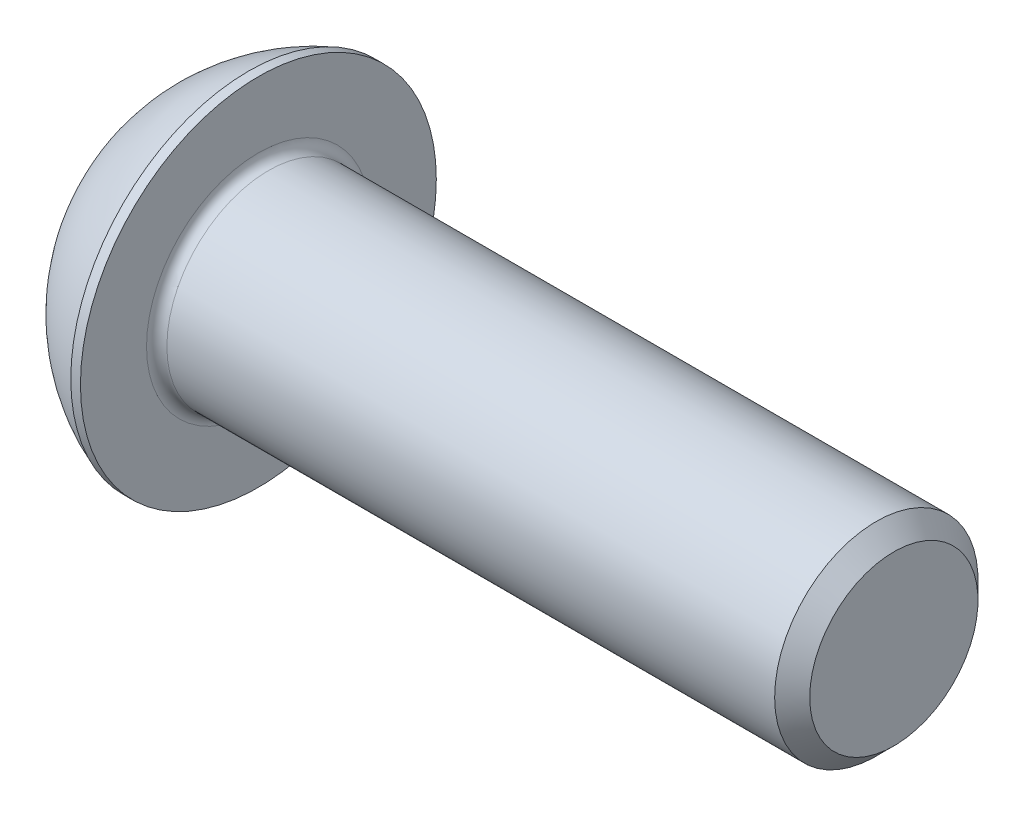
ISO-10303-21;
HEADER;
FILE_DESCRIPTION(('STEP AP214'),'2;1');
FILE_NAME('part.step','',(''),(''),'','','');
FILE_SCHEMA(('AUTOMOTIVE_DESIGN { 1 0 10303 214 1 1 1 1 }'));
ENDSEC;
DATA;
#1=APPLICATION_CONTEXT('core data for automotive mechanical design processes');
#2=APPLICATION_PROTOCOL_DEFINITION('international standard','automotive_design',2000,#1);
#3=PRODUCT_CONTEXT('',#1,'mechanical');
#4=PRODUCT('Part','Part','',(#3));
#5=PRODUCT_RELATED_PRODUCT_CATEGORY('part','',(#4));
#6=PRODUCT_DEFINITION_FORMATION('','',#4);
#7=PRODUCT_DEFINITION_CONTEXT('part definition',#1,'design');
#8=PRODUCT_DEFINITION('design','',#6,#7);
#9=PRODUCT_DEFINITION_SHAPE('','',#8);
#10=(LENGTH_UNIT() NAMED_UNIT(*) SI_UNIT(.MILLI.,.METRE.));
#11=(NAMED_UNIT(*) PLANE_ANGLE_UNIT() SI_UNIT($,.RADIAN.));
#12=(NAMED_UNIT(*) SI_UNIT($,.STERADIAN.) SOLID_ANGLE_UNIT());
#13=UNCERTAINTY_MEASURE_WITH_UNIT(LENGTH_MEASURE(1.E-05),#10,'distance_accuracy_value','');
#14=(GEOMETRIC_REPRESENTATION_CONTEXT(3) GLOBAL_UNCERTAINTY_ASSIGNED_CONTEXT((#13)) GLOBAL_UNIT_ASSIGNED_CONTEXT((#10,
#11,#12)) REPRESENTATION_CONTEXT('',''));
#15=CARTESIAN_POINT('',(0.,0.,0.));
#16=DIRECTION('',(0.,0.,1.));
#17=DIRECTION('',(1.,0.,0.));
#18=AXIS2_PLACEMENT_3D('',#15,#16,#17);
#19=CARTESIAN_POINT('',(0.,0.,0.));
#20=DIRECTION('',(-1.,0.,0.));
#21=DIRECTION('',(0.,0.,1.));
#22=AXIS2_PLACEMENT_3D('',#19,#20,#21);
#23=PLANE('',#22);
#24=CARTESIAN_POINT('',(0.,0.,0.));
#25=DIRECTION('',(-1.,0.,0.));
#26=DIRECTION('',(0.,0.,1.));
#27=AXIS2_PLACEMENT_3D('',#24,#25,#26);
#28=CIRCLE('',#27,3.5);
#29=CARTESIAN_POINT('',(0.,3.5,0.));
#30=VERTEX_POINT('',#29);
#31=EDGE_CURVE('E174',#30,#30,#28,.T.);
#32=ORIENTED_EDGE('',*,*,#31,.T.);
#33=EDGE_LOOP('',(#32));
#34=FACE_BOUND('',#33,.T.);
#35=DIRECTION('',(0.,-1.,0.));
#36=VECTOR('',#35,1.);
#37=CARTESIAN_POINT('',(0.,-1.44337567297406,2.5));
#38=LINE('',#37,#36);
#39=CARTESIAN_POINT('',(0.,1.44337567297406,2.5));
#40=VERTEX_POINT('',#39);
#41=CARTESIAN_POINT('',(0.,-1.44337567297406,2.5));
#42=VERTEX_POINT('',#41);
#43=EDGE_CURVE('E59',#40,#42,#38,.T.);
#44=ORIENTED_EDGE('',*,*,#43,.T.);
#45=DIRECTION('',(0.,-0.5,-0.866025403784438));
#46=VECTOR('',#45,1.);
#47=CARTESIAN_POINT('',(0.,-2.88675134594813,0.));
#48=LINE('',#47,#46);
#49=CARTESIAN_POINT('',(0.,-2.88675134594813,0.));
#50=VERTEX_POINT('',#49);
#51=EDGE_CURVE('E301',#42,#50,#48,.T.);
#52=ORIENTED_EDGE('',*,*,#51,.T.);
#53=DIRECTION('',(0.,0.5,-0.866025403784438));
#54=VECTOR('',#53,1.);
#55=CARTESIAN_POINT('',(0.,-1.44337567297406,-2.5));
#56=LINE('',#55,#54);
#57=CARTESIAN_POINT('',(0.,-1.44337567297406,-2.5));
#58=VERTEX_POINT('',#57);
#59=EDGE_CURVE('E141',#50,#58,#56,.T.);
#60=ORIENTED_EDGE('',*,*,#59,.T.);
#61=DIRECTION('',(0.,1.,0.));
#62=VECTOR('',#61,1.);
#63=CARTESIAN_POINT('',(0.,1.44337567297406,-2.5));
#64=LINE('',#63,#62);
#65=CARTESIAN_POINT('',(0.,1.44337567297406,-2.5));
#66=VERTEX_POINT('',#65);
#67=EDGE_CURVE('E306',#58,#66,#64,.T.);
#68=ORIENTED_EDGE('',*,*,#67,.T.);
#69=DIRECTION('',(0.,0.5,0.866025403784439));
#70=VECTOR('',#69,1.);
#71=CARTESIAN_POINT('',(0.,2.88675134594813,0.));
#72=LINE('',#71,#70);
#73=CARTESIAN_POINT('',(0.,2.88675134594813,0.));
#74=VERTEX_POINT('',#73);
#75=EDGE_CURVE('E309',#66,#74,#72,.T.);
#76=ORIENTED_EDGE('',*,*,#75,.T.);
#77=DIRECTION('',(0.,-0.5,0.866025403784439));
#78=VECTOR('',#77,1.);
#79=CARTESIAN_POINT('',(0.,1.44337567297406,2.5));
#80=LINE('',#79,#78);
#81=EDGE_CURVE('E312',#74,#40,#80,.T.);
#82=ORIENTED_EDGE('',*,*,#81,.T.);
#83=EDGE_LOOP('',(#44,#52,#60,#68,#76,#82));
#84=FACE_BOUND('',#83,.T.);
#85=ADVANCED_FACE('F43',(#34,#84),#23,.T.);
#86=CARTESIAN_POINT('',(6.58089552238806,0.,0.));
#87=DIRECTION('',(-1.,0.,0.));
#88=DIRECTION('',(0.,1.,0.));
#89=AXIS2_PLACEMENT_3D('',#86,#87,#88);
#90=SPHERICAL_SURFACE('',#89,7.45373637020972);
#91=CARTESIAN_POINT('',(4.02,0.,0.));
#92=DIRECTION('',(-1.,0.,0.));
#93=DIRECTION('',(0.,0.,1.));
#94=AXIS2_PLACEMENT_3D('',#91,#92,#93);
#95=CIRCLE('',#94,7.);
#96=CARTESIAN_POINT('',(4.02,7.,0.));
#97=VERTEX_POINT('',#96);
#98=EDGE_CURVE('E170',#97,#97,#95,.T.);
#99=CARTESIAN_POINT('',(4.02,7.,0.));
#100=CARTESIAN_POINT('',(3.96667727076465,6.98049242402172,0.));
#101=CARTESIAN_POINT('',(3.91357752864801,6.96037534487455,0.));
#102=CARTESIAN_POINT('',(3.8078515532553,6.91893318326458,0.));
#103=CARTESIAN_POINT('',(3.75522531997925,6.89760810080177,0.));
#104=CARTESIAN_POINT('',(3.65047389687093,6.85376093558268,0.));
#105=CARTESIAN_POINT('',(3.59834870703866,6.83123885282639,0.));
#106=CARTESIAN_POINT('',(3.49462657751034,6.7850094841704,0.));
#107=CARTESIAN_POINT('',(3.44302963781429,6.7613021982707,0.));
#108=CARTESIAN_POINT('',(3.34039095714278,6.71271479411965,0.));
#109=CARTESIAN_POINT('',(3.28934921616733,6.6878346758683,0.));
#110=CARTESIAN_POINT('',(3.18784758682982,6.63691460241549,0.));
#111=CARTESIAN_POINT('',(3.13738769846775,6.61087464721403,0.));
#112=CARTESIAN_POINT('',(3.03707612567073,6.55764849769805,0.));
#113=CARTESIAN_POINT('',(2.98722444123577,6.53046230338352,0.));
#114=CARTESIAN_POINT('',(2.88815530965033,6.47495787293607,0.));
#115=CARTESIAN_POINT('',(2.83893786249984,6.44663963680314,0.));
#116=CARTESIAN_POINT('',(2.74116290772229,6.38888591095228,0.));
#117=CARTESIAN_POINT('',(2.69260540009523,6.35945042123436,0.));
#118=CARTESIAN_POINT('',(2.59617568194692,6.29947755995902,0.));
#119=CARTESIAN_POINT('',(2.54830347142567,6.2689401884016,0.));
#120=CARTESIAN_POINT('',(2.45326934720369,6.20677951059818,0.));
#121=CARTESIAN_POINT('',(2.40610743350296,6.17515620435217,0.));
#122=CARTESIAN_POINT('',(2.31251853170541,6.1108401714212,0.));
#123=CARTESIAN_POINT('',(2.2660915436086,6.07814744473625,0.));
#124=CARTESIAN_POINT('',(2.17399673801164,6.01170964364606,0.));
#125=CARTESIAN_POINT('',(2.12832892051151,5.97796456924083,0.));
#126=CARTESIAN_POINT('',(2.03777630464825,5.90943969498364,0.));
#127=CARTESIAN_POINT('',(1.99289150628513,5.87465989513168,0.));
#128=CARTESIAN_POINT('',(1.90392836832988,5.80408373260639,0.));
#129=CARTESIAN_POINT('',(1.85985002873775,5.76828736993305,0.));
#130=CARTESIAN_POINT('',(1.77252282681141,5.69569677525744,0.));
#131=CARTESIAN_POINT('',(1.72927396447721,5.65890254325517,0.));
#132=CARTESIAN_POINT('',(1.64362830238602,5.58433542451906,0.));
#133=CARTESIAN_POINT('',(1.60123150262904,5.54656253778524,0.));
#134=CARTESIAN_POINT('',(1.51731210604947,5.4700578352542,0.));
#135=CARTESIAN_POINT('',(1.47578950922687,5.431326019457,0.));
#136=CARTESIAN_POINT('',(1.39364020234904,5.35292368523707,0.));
#137=CARTESIAN_POINT('',(1.35301349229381,5.31325316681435,0.));
#138=CARTESIAN_POINT('',(1.27267717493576,5.23299414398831,0.));
#139=CARTESIAN_POINT('',(1.23296756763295,5.19240563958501,0.));
#140=CARTESIAN_POINT('',(1.15448619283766,5.1103318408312,0.));
#141=CARTESIAN_POINT('',(1.11571442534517,5.0688465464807,0.));
#142=CARTESIAN_POINT('',(1.03912897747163,4.98500083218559,0.));
#143=CARTESIAN_POINT('',(1.00131529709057,4.94264041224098,0.));
#144=CARTESIAN_POINT('',(0.926665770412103,4.85706656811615,0.));
#145=CARTESIAN_POINT('',(0.889829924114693,4.81385314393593,0.));
#146=CARTESIAN_POINT('',(0.817155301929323,4.72659585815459,0.));
#147=CARTESIAN_POINT('',(0.781316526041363,4.68255199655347,0.));
#148=CARTESIAN_POINT('',(0.710654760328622,4.59365683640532,0.));
#149=CARTESIAN_POINT('',(0.675831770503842,4.54880553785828,0.));
#150=CARTESIAN_POINT('',(0.607219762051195,4.45831892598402,0.));
#151=CARTESIAN_POINT('',(0.573430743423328,4.41268361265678,0.));
#152=CARTESIAN_POINT('',(0.506904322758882,4.32065280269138,0.));
#153=CARTESIAN_POINT('',(0.474166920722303,4.27425730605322,0.));
#154=CARTESIAN_POINT('',(0.409760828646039,4.18073035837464,0.));
#155=CARTESIAN_POINT('',(0.378092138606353,4.1335989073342,0.));
#156=CARTESIAN_POINT('',(0.315840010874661,4.03862466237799,0.));
#157=CARTESIAN_POINT('',(0.285256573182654,3.99078186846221,0.));
#158=CARTESIAN_POINT('',(0.2251909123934,3.89440992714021,0.));
#159=CARTESIAN_POINT('',(0.195708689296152,3.84588077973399,0.));
#160=CARTESIAN_POINT('',(0.137860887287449,3.74816145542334,0.));
#161=CARTESIAN_POINT('',(0.109495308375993,3.69897127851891,0.));
#162=CARTESIAN_POINT('',(0.0538954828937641,3.59995565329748,0.));
#163=CARTESIAN_POINT('',(0.0266612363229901,3.55013020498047,0.));
#164=CARTESIAN_POINT('',(0.,3.5,0.));
#165=B_SPLINE_CURVE_WITH_KNOTS('',3,(#99,#100,#101,#102,#103,#104,#105,#106,#107,#108,#109,#110,
#111,#112,#113,#114,#115,#116,#117,#118,#119,#120,#121,#122,#123,#124,#125,#126,#127,#128,#129,
#130,#131,#132,#133,#134,#135,#136,#137,#138,#139,#140,#141,#142,#143,#144,#145,#146,#147,#148,
#149,#150,#151,#152,#153,#154,#155,#156,#157,#158,#159,#160,#161,#162,#163,#164),.UNSPECIFIED.,
.F.,.F.,(4,2,2,2,2,2,2,2,2,2,2,2,2,2,2,2,2,2,2,2,2,2,2,2,2,2,2,2,2,2,2,2,4),(0.,
0.170333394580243,0.340666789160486,0.51100018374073,0.681333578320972,0.851666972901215,
1.02200036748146,1.1923337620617,1.36266715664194,1.53300055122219,1.70333394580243,
1.87366734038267,2.04400073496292,2.21433412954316,2.3846675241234,2.55500091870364,
2.72533431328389,2.89566770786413,3.06600110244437,3.23633449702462,3.40666789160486,
3.5770012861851,3.74733468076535,3.91766807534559,4.08800146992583,4.25833486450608,
4.42866825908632,4.59900165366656,4.7693350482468,4.93966844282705,5.11000183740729,
5.28033523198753,5.45066862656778),.UNSPECIFIED.);
#166=EDGE_CURVE('BSEAM197',#97,#30,#165,.T.);
#167=ORIENTED_EDGE('',*,*,#98,.T.);
#168=ORIENTED_EDGE('',*,*,#31,.F.);
#169=ORIENTED_EDGE('',*,*,#166,.T.);
#170=ORIENTED_EDGE('',*,*,#166,.F.);
#171=EDGE_LOOP('',(#167,#169,#168,#170));
#172=FACE_BOUND('',#171,.T.);
#173=ADVANCED_FACE('F197',(#172),#90,.T.);
#174=CARTESIAN_POINT('',(0.,0.,0.));
#175=DIRECTION('',(-1.,0.,0.));
#176=DIRECTION('',(0.,0.,1.));
#177=AXIS2_PLACEMENT_3D('',#174,#175,#176);
#178=CYLINDRICAL_SURFACE('',#177,7.);
#179=ORIENTED_EDGE('',*,*,#98,.F.);
#180=EDGE_LOOP('',(#179));
#181=FACE_BOUND('',#180,.T.);
#182=CARTESIAN_POINT('',(4.4,0.,0.));
#183=DIRECTION('',(-1.,0.,0.));
#184=DIRECTION('',(0.,0.,1.));
#185=AXIS2_PLACEMENT_3D('',#182,#183,#184);
#186=CIRCLE('',#185,7.);
#187=CARTESIAN_POINT('',(4.4,0.,7.));
#188=VERTEX_POINT('',#187);
#189=EDGE_CURVE('E166',#188,#188,#186,.T.);
#190=ORIENTED_EDGE('',*,*,#189,.T.);
#191=EDGE_LOOP('',(#190));
#192=FACE_BOUND('',#191,.T.);
#193=ADVANCED_FACE('F202',(#181,#192),#178,.T.);
#194=CARTESIAN_POINT('',(4.4,4.,0.));
#195=DIRECTION('',(-1.,0.,0.));
#196=DIRECTION('',(0.,0.,1.));
#197=AXIS2_PLACEMENT_3D('',#194,#195,#196);
#198=PLANE('',#197);
#199=CARTESIAN_POINT('',(4.4,0.,0.));
#200=DIRECTION('',(-1.,0.,0.));
#201=DIRECTION('',(0.,0.,1.));
#202=AXIS2_PLACEMENT_3D('',#199,#200,#201);
#203=CIRCLE('',#202,4.4);
#204=CARTESIAN_POINT('',(4.4,0.,4.4));
#205=VERTEX_POINT('',#204);
#206=EDGE_CURVE('E52',#205,#205,#203,.T.);
#207=ORIENTED_EDGE('',*,*,#206,.T.);
#208=EDGE_LOOP('',(#207));
#209=FACE_BOUND('',#208,.T.);
#210=ORIENTED_EDGE('',*,*,#189,.F.);
#211=EDGE_LOOP('',(#210));
#212=FACE_BOUND('',#211,.T.);
#213=ADVANCED_FACE('F181',(#209,#212),#198,.F.);
#214=CARTESIAN_POINT('',(0.,0.,0.));
#215=DIRECTION('',(-1.,0.,0.));
#216=DIRECTION('',(0.,0.,1.));
#217=AXIS2_PLACEMENT_3D('',#214,#215,#216);
#218=CYLINDRICAL_SURFACE('',#217,4.);
#219=CARTESIAN_POINT('',(4.8,0.,0.));
#220=DIRECTION('',(-1.,0.,0.));
#221=DIRECTION('',(0.,0.,1.));
#222=AXIS2_PLACEMENT_3D('',#219,#220,#221);
#223=CIRCLE('',#222,4.);
#224=CARTESIAN_POINT('',(4.8,0.,4.));
#225=VERTEX_POINT('',#224);
#226=EDGE_CURVE('E11',#225,#225,#223,.F.);
#227=ORIENTED_EDGE('',*,*,#226,.T.);
#228=EDGE_LOOP('',(#227));
#229=FACE_BOUND('',#228,.T.);
#230=CARTESIAN_POINT('',(28.7095,0.,0.));
#231=DIRECTION('',(-1.,0.,0.));
#232=DIRECTION('',(0.,0.,1.));
#233=AXIS2_PLACEMENT_3D('',#230,#231,#232);
#234=CIRCLE('',#233,4.);
#235=CARTESIAN_POINT('',(28.7095,0.,4.));
#236=VERTEX_POINT('',#235);
#237=EDGE_CURVE('E162',#236,#236,#234,.T.);
#238=ORIENTED_EDGE('',*,*,#237,.T.);
#239=EDGE_LOOP('',(#238));
#240=FACE_BOUND('',#239,.T.);
#241=ADVANCED_FACE('F211',(#229,#240),#218,.T.);
#242=CARTESIAN_POINT('',(29.4,0.,0.));
#243=DIRECTION('',(-1.,0.,0.));
#244=DIRECTION('',(0.,0.,1.));
#245=AXIS2_PLACEMENT_3D('',#242,#243,#244);
#246=CONICAL_SURFACE('',#245,3.3095,0.785398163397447);
#247=ORIENTED_EDGE('',*,*,#237,.F.);
#248=EDGE_LOOP('',(#247));
#249=FACE_BOUND('',#248,.T.);
#250=CARTESIAN_POINT('',(29.4,0.,0.));
#251=DIRECTION('',(-1.,0.,0.));
#252=DIRECTION('',(0.,0.,1.));
#253=AXIS2_PLACEMENT_3D('',#250,#251,#252);
#254=CIRCLE('',#253,3.3095);
#255=CARTESIAN_POINT('',(29.4,0.,3.3095));
#256=VERTEX_POINT('',#255);
#257=EDGE_CURVE('E157',#256,#256,#254,.T.);
#258=ORIENTED_EDGE('',*,*,#257,.T.);
#259=EDGE_LOOP('',(#258));
#260=FACE_BOUND('',#259,.T.);
#261=ADVANCED_FACE('F192',(#249,#260),#246,.T.);
#262=CARTESIAN_POINT('',(29.4,0.,0.));
#263=DIRECTION('',(-1.,0.,0.));
#264=DIRECTION('',(0.,0.,1.));
#265=AXIS2_PLACEMENT_3D('',#262,#263,#264);
#266=PLANE('',#265);
#267=ORIENTED_EDGE('',*,*,#257,.F.);
#268=EDGE_LOOP('',(#267));
#269=FACE_BOUND('',#268,.T.);
#270=ADVANCED_FACE('F185',(#269),#266,.F.);
#271=CARTESIAN_POINT('',(4.8,0.,0.));
#272=DIRECTION('',(-1.,0.,0.));
#273=DIRECTION('',(0.,0.,1.));
#274=AXIS2_PLACEMENT_3D('',#271,#272,#273);
#275=TOROIDAL_SURFACE('',#274,4.4,0.4);
#276=ORIENTED_EDGE('',*,*,#226,.F.);
#277=EDGE_LOOP('',(#276));
#278=FACE_BOUND('',#277,.T.);
#279=ORIENTED_EDGE('',*,*,#206,.F.);
#280=EDGE_LOOP('',(#279));
#281=FACE_BOUND('',#280,.T.);
#282=ADVANCED_FACE('F45',(#278,#281),#275,.F.);
#283=CARTESIAN_POINT('',(2.6,-2.88675134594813,0.));
#284=DIRECTION('',(0.,0.866025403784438,-0.5));
#285=DIRECTION('',(0.,0.5,0.866025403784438));
#286=AXIS2_PLACEMENT_3D('',#283,#284,#285);
#287=PLANE('',#286);
#288=DIRECTION('',(0.,-0.5,-0.866025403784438));
#289=VECTOR('',#288,1.);
#290=CARTESIAN_POINT('',(2.6,-2.88675134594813,0.));
#291=LINE('',#290,#289);
#292=CARTESIAN_POINT('',(2.6,-1.44337567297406,2.5));
#293=VERTEX_POINT('',#292);
#294=CARTESIAN_POINT('',(2.6,-2.1650635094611,1.25));
#295=VERTEX_POINT('',#294);
#296=EDGE_CURVE('E125',#293,#295,#291,.T.);
#297=ORIENTED_EDGE('',*,*,#296,.T.);
#298=CARTESIAN_POINT('',(2.6,-2.88675134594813,0.));
#299=VERTEX_POINT('',#298);
#300=EDGE_CURVE('E120',#295,#299,#291,.T.);
#301=ORIENTED_EDGE('',*,*,#300,.T.);
#302=DIRECTION('',(-1.,0.,0.));
#303=VECTOR('',#302,1.);
#304=CARTESIAN_POINT('',(2.6,-2.88675134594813,0.));
#305=LINE('',#304,#303);
#306=EDGE_CURVE('E122',#299,#50,#305,.T.);
#307=ORIENTED_EDGE('',*,*,#306,.T.);
#308=ORIENTED_EDGE('',*,*,#51,.F.);
#309=DIRECTION('',(-1.,0.,0.));
#310=VECTOR('',#309,1.);
#311=CARTESIAN_POINT('',(2.6,-1.44337567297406,2.5));
#312=LINE('',#311,#310);
#313=EDGE_CURVE('E300',#293,#42,#312,.T.);
#314=ORIENTED_EDGE('',*,*,#313,.F.);
#315=EDGE_LOOP('',(#297,#301,#307,#308,#314));
#316=FACE_BOUND('',#315,.T.);
#317=ADVANCED_FACE('F121',(#316),#287,.T.);
#318=CARTESIAN_POINT('',(2.6,-1.44337567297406,-2.5));
#319=DIRECTION('',(0.,0.866025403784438,0.5));
#320=DIRECTION('',(0.,-0.5,0.866025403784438));
#321=AXIS2_PLACEMENT_3D('',#318,#319,#320);
#322=PLANE('',#321);
#323=DIRECTION('',(0.,0.5,-0.866025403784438));
#324=VECTOR('',#323,1.);
#325=CARTESIAN_POINT('',(2.6,-1.44337567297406,-2.5));
#326=LINE('',#325,#324);
#327=CARTESIAN_POINT('',(2.6,-2.1650635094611,-1.25));
#328=VERTEX_POINT('',#327);
#329=EDGE_CURVE('E67',#299,#328,#326,.T.);
#330=ORIENTED_EDGE('',*,*,#329,.T.);
#331=CARTESIAN_POINT('',(2.6,-1.44337567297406,-2.5));
#332=VERTEX_POINT('',#331);
#333=EDGE_CURVE('E136',#328,#332,#326,.T.);
#334=ORIENTED_EDGE('',*,*,#333,.T.);
#335=DIRECTION('',(-1.,0.,0.));
#336=VECTOR('',#335,1.);
#337=CARTESIAN_POINT('',(2.6,-1.44337567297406,-2.5));
#338=LINE('',#337,#336);
#339=EDGE_CURVE('E144',#332,#58,#338,.T.);
#340=ORIENTED_EDGE('',*,*,#339,.T.);
#341=ORIENTED_EDGE('',*,*,#59,.F.);
#342=ORIENTED_EDGE('',*,*,#306,.F.);
#343=EDGE_LOOP('',(#330,#334,#340,#341,#342));
#344=FACE_BOUND('',#343,.T.);
#345=ADVANCED_FACE('F139',(#344),#322,.T.);
#346=CARTESIAN_POINT('',(2.6,1.44337567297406,-2.5));
#347=DIRECTION('',(0.,0.,1.));
#348=DIRECTION('',(1.,0.,0.));
#349=AXIS2_PLACEMENT_3D('',#346,#347,#348);
#350=PLANE('',#349);
#351=DIRECTION('',(0.,1.,0.));
#352=VECTOR('',#351,1.);
#353=CARTESIAN_POINT('',(2.6,1.44337567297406,-2.5));
#354=LINE('',#353,#352);
#355=CARTESIAN_POINT('',(2.6,0.,-2.5));
#356=VERTEX_POINT('',#355);
#357=EDGE_CURVE('E275',#332,#356,#354,.T.);
#358=ORIENTED_EDGE('',*,*,#357,.T.);
#359=CARTESIAN_POINT('',(2.6,1.44337567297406,-2.5));
#360=VERTEX_POINT('',#359);
#361=EDGE_CURVE('E135',#356,#360,#354,.T.);
#362=ORIENTED_EDGE('',*,*,#361,.T.);
#363=DIRECTION('',(-1.,0.,0.));
#364=VECTOR('',#363,1.);
#365=CARTESIAN_POINT('',(2.6,1.44337567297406,-2.5));
#366=LINE('',#365,#364);
#367=EDGE_CURVE('E151',#360,#66,#366,.T.);
#368=ORIENTED_EDGE('',*,*,#367,.T.);
#369=ORIENTED_EDGE('',*,*,#67,.F.);
#370=ORIENTED_EDGE('',*,*,#339,.F.);
#371=EDGE_LOOP('',(#358,#362,#368,#369,#370));
#372=FACE_BOUND('',#371,.T.);
#373=ADVANCED_FACE('F225',(#372),#350,.T.);
#374=CARTESIAN_POINT('',(2.6,2.88675134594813,0.));
#375=DIRECTION('',(0.,-0.866025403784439,0.5));
#376=DIRECTION('',(0.,-0.5,-0.866025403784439));
#377=AXIS2_PLACEMENT_3D('',#374,#375,#376);
#378=PLANE('',#377);
#379=DIRECTION('',(0.,0.5,0.866025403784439));
#380=VECTOR('',#379,1.);
#381=CARTESIAN_POINT('',(2.6,2.88675134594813,0.));
#382=LINE('',#381,#380);
#383=CARTESIAN_POINT('',(2.6,2.1650635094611,-1.25));
#384=VERTEX_POINT('',#383);
#385=EDGE_CURVE('E262',#360,#384,#382,.T.);
#386=ORIENTED_EDGE('',*,*,#385,.T.);
#387=CARTESIAN_POINT('',(2.6,2.88675134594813,0.));
#388=VERTEX_POINT('',#387);
#389=EDGE_CURVE('E268',#384,#388,#382,.T.);
#390=ORIENTED_EDGE('',*,*,#389,.T.);
#391=DIRECTION('',(-1.,0.,0.));
#392=VECTOR('',#391,1.);
#393=CARTESIAN_POINT('',(2.6,2.88675134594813,0.));
#394=LINE('',#393,#392);
#395=EDGE_CURVE('E324',#388,#74,#394,.T.);
#396=ORIENTED_EDGE('',*,*,#395,.T.);
#397=ORIENTED_EDGE('',*,*,#75,.F.);
#398=ORIENTED_EDGE('',*,*,#367,.F.);
#399=EDGE_LOOP('',(#386,#390,#396,#397,#398));
#400=FACE_BOUND('',#399,.T.);
#401=ADVANCED_FACE('F228',(#400),#378,.T.);
#402=CARTESIAN_POINT('',(2.6,1.44337567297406,2.5));
#403=DIRECTION('',(0.,-0.866025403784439,-0.5));
#404=DIRECTION('',(0.,0.5,-0.866025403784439));
#405=AXIS2_PLACEMENT_3D('',#402,#403,#404);
#406=PLANE('',#405);
#407=DIRECTION('',(0.,-0.5,0.866025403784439));
#408=VECTOR('',#407,1.);
#409=CARTESIAN_POINT('',(2.6,1.44337567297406,2.5));
#410=LINE('',#409,#408);
#411=CARTESIAN_POINT('',(2.6,2.1650635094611,1.25));
#412=VERTEX_POINT('',#411);
#413=EDGE_CURVE('E271',#388,#412,#410,.T.);
#414=ORIENTED_EDGE('',*,*,#413,.T.);
#415=CARTESIAN_POINT('',(2.6,1.44337567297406,2.5));
#416=VERTEX_POINT('',#415);
#417=EDGE_CURVE('E281',#412,#416,#410,.T.);
#418=ORIENTED_EDGE('',*,*,#417,.T.);
#419=DIRECTION('',(-1.,0.,0.));
#420=VECTOR('',#419,1.);
#421=CARTESIAN_POINT('',(2.6,1.44337567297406,2.5));
#422=LINE('',#421,#420);
#423=EDGE_CURVE('E320',#416,#40,#422,.T.);
#424=ORIENTED_EDGE('',*,*,#423,.T.);
#425=ORIENTED_EDGE('',*,*,#81,.F.);
#426=ORIENTED_EDGE('',*,*,#395,.F.);
#427=EDGE_LOOP('',(#414,#418,#424,#425,#426));
#428=FACE_BOUND('',#427,.T.);
#429=ADVANCED_FACE('F232',(#428),#406,.T.);
#430=CARTESIAN_POINT('',(2.6,-1.44337567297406,2.5));
#431=DIRECTION('',(0.,0.,-1.));
#432=DIRECTION('',(-1.,0.,0.));
#433=AXIS2_PLACEMENT_3D('',#430,#431,#432);
#434=PLANE('',#433);
#435=DIRECTION('',(0.,-1.,0.));
#436=VECTOR('',#435,1.);
#437=CARTESIAN_POINT('',(2.6,-1.44337567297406,2.5));
#438=LINE('',#437,#436);
#439=CARTESIAN_POINT('',(2.6,0.,2.5));
#440=VERTEX_POINT('',#439);
#441=EDGE_CURVE('E296',#416,#440,#438,.T.);
#442=ORIENTED_EDGE('',*,*,#441,.T.);
#443=EDGE_CURVE('E295',#440,#293,#438,.T.);
#444=ORIENTED_EDGE('',*,*,#443,.T.);
#445=ORIENTED_EDGE('',*,*,#313,.T.);
#446=ORIENTED_EDGE('',*,*,#43,.F.);
#447=ORIENTED_EDGE('',*,*,#423,.F.);
#448=EDGE_LOOP('',(#442,#444,#445,#446,#447));
#449=FACE_BOUND('',#448,.T.);
#450=ADVANCED_FACE('F236',(#449),#434,.T.);
#451=CARTESIAN_POINT('',(2.6,-2.88675134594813,0.));
#452=DIRECTION('',(1.,0.,0.));
#453=DIRECTION('',(0.,0.,-1.));
#454=AXIS2_PLACEMENT_3D('',#451,#452,#453);
#455=PLANE('',#454);
#456=CARTESIAN_POINT('',(2.6,0.,0.));
#457=DIRECTION('',(-1.,0.,0.));
#458=DIRECTION('',(0.,0.,1.));
#459=AXIS2_PLACEMENT_3D('',#456,#457,#458);
#460=CIRCLE('',#459,2.5);
#461=EDGE_CURVE('E259',#384,#356,#460,.T.);
#462=ORIENTED_EDGE('',*,*,#461,.F.);
#463=ORIENTED_EDGE('',*,*,#385,.F.);
#464=ORIENTED_EDGE('',*,*,#361,.F.);
#465=EDGE_LOOP('',(#462,#463,#464));
#466=FACE_BOUND('',#465,.T.);
#467=ADVANCED_FACE('F240',(#466),#455,.F.);
#468=EDGE_CURVE('E158',#412,#384,#460,.T.);
#469=ORIENTED_EDGE('',*,*,#468,.F.);
#470=ORIENTED_EDGE('',*,*,#413,.F.);
#471=ORIENTED_EDGE('',*,*,#389,.F.);
#472=EDGE_LOOP('',(#469,#470,#471));
#473=FACE_BOUND('',#472,.T.);
#474=ADVANCED_FACE('F249',(#473),#455,.F.);
#475=EDGE_CURVE('E150',#440,#412,#460,.T.);
#476=ORIENTED_EDGE('',*,*,#475,.F.);
#477=ORIENTED_EDGE('',*,*,#441,.F.);
#478=ORIENTED_EDGE('',*,*,#417,.F.);
#479=EDGE_LOOP('',(#476,#477,#478));
#480=FACE_BOUND('',#479,.T.);
#481=ADVANCED_FACE('F254',(#480),#455,.F.);
#482=EDGE_CURVE('E143',#295,#440,#460,.T.);
#483=ORIENTED_EDGE('',*,*,#482,.F.);
#484=ORIENTED_EDGE('',*,*,#296,.F.);
#485=ORIENTED_EDGE('',*,*,#443,.F.);
#486=EDGE_LOOP('',(#483,#484,#485));
#487=FACE_BOUND('',#486,.T.);
#488=ADVANCED_FACE('F247',(#487),#455,.F.);
#489=EDGE_CURVE('E132',#328,#295,#460,.T.);
#490=ORIENTED_EDGE('',*,*,#489,.F.);
#491=ORIENTED_EDGE('',*,*,#329,.F.);
#492=ORIENTED_EDGE('',*,*,#300,.F.);
#493=EDGE_LOOP('',(#490,#491,#492));
#494=FACE_BOUND('',#493,.T.);
#495=ADVANCED_FACE('F131',(#494),#455,.F.);
#496=EDGE_CURVE('E266',#356,#328,#460,.T.);
#497=ORIENTED_EDGE('',*,*,#496,.F.);
#498=ORIENTED_EDGE('',*,*,#357,.F.);
#499=ORIENTED_EDGE('',*,*,#333,.F.);
#500=EDGE_LOOP('',(#497,#498,#499));
#501=FACE_BOUND('',#500,.T.);
#502=ADVANCED_FACE('F220',(#501),#455,.F.);
#503=CARTESIAN_POINT('',(4.04337567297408,0.,0.));
#504=DIRECTION('',(-1.,0.,0.));
#505=DIRECTION('',(0.,0.,1.));
#506=AXIS2_PLACEMENT_3D('',#503,#504,#505);
#507=CONICAL_SURFACE('',#506,0.,1.04719755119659);
#508=ORIENTED_EDGE('',*,*,#475,.T.);
#509=ORIENTED_EDGE('',*,*,#468,.T.);
#510=ORIENTED_EDGE('',*,*,#461,.T.);
#511=ORIENTED_EDGE('',*,*,#496,.T.);
#512=ORIENTED_EDGE('',*,*,#489,.T.);
#513=ORIENTED_EDGE('',*,*,#482,.T.);
#514=EDGE_LOOP('',(#508,#509,#510,#511,#512,#513));
#515=FACE_BOUND('',#514,.T.);
#516=CARTESIAN_POINT('',(4.04337567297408,0.,0.));
#517=VERTEX_POINT('',#516);
#518=VERTEX_LOOP('',#517);
#519=FACE_BOUND('',#518,.T.);
#520=ADVANCED_FACE('F218',(#515,#519),#507,.F.);
#521=CLOSED_SHELL('',(#85,#173,#193,#213,#241,#261,#270,#282,#317,#345,#373,#401,#429,#450,#467,
#474,#481,#488,#495,#502,#520));
#522=MANIFOLD_SOLID_BREP('B2',#521);
#523=ADVANCED_BREP_SHAPE_REPRESENTATION('',(#18,#522),#14);
#524=SHAPE_DEFINITION_REPRESENTATION(#9,#523);
ENDSEC;
END-ISO-10303-21;
